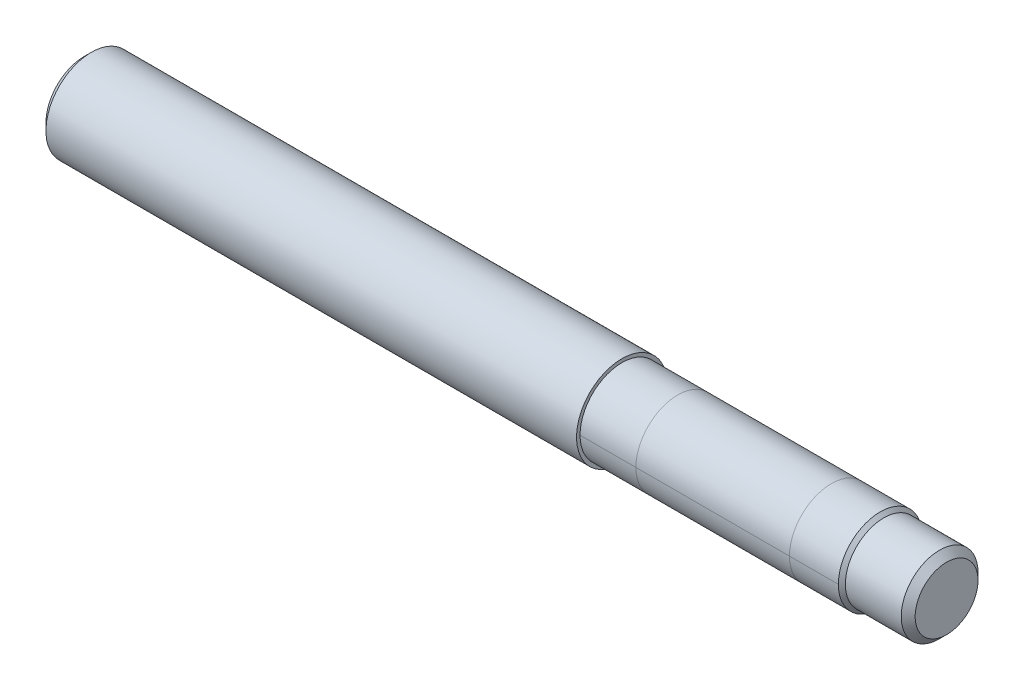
from build123d import *

# Parameters (mm, degrees)
SKETCH1_R          = 6.5
EXTRUDE1_DEPTH     = 123.5
SKETCH2_OUTSIDE_W  = 39.972
SKETCH2_OUTSIDE_H  = 39.972
SKETCH2_OUTSIDE_R  = 6
CUT_EXTRUDE1_DEPTH = 46.5
CHAMFER1_SIZE      = 1


with BuildPart() as part:
    # Sketch1 → Extrude1 (new body)
    with BuildSketch(Plane(origin=(0, 0, 0), x_dir=(0, 0, -1), z_dir=(1, 0, 0))):
        Circle(SKETCH1_R)
    extrude(amount=EXTRUDE1_DEPTH)

    # Sketch2 outside → Cut-Extrude1 (cut)
    with BuildSketch(Plane(origin=(123.5, 0, 0), x_dir=(0, 0, -1), z_dir=(1, 0, 0))):
        Rectangle(SKETCH2_OUTSIDE_W, SKETCH2_OUTSIDE_H)
        Circle(SKETCH2_OUTSIDE_R, mode=Mode.SUBTRACT)
    extrude(amount=-CUT_EXTRUDE1_DEPTH, mode=Mode.SUBTRACT)

    # Sketch3 → Cut-Revolve1 (revolve, cut)
    with BuildSketch(Plane.XY, mode=Mode.PRIVATE) as cut_revolve1_sk:
        Polygon((123.5, 10.253952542), (123.5, 5.5), (114.5, 5.5), (112.600148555, 7.399851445), (112.600148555, 10.253952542), align=None)
    revolve(cut_revolve1_sk.sketch.rotate(Axis((127.965017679, 0, 0), (-1, 0, 0)), 90), axis=Axis((127.965017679, 0, 0), (-1, 0, 0)), mode=Mode.SUBTRACT)

    # Chamfer1
    chamfer1_edges = [part.edges().sort_by_distance(p)[0] for p in [
        (0, 0, 6.5),
        (123.5, 0, 5.5),
    ]]
    chamfer(chamfer1_edges, length=CHAMFER1_SIZE)


solid = part.part
